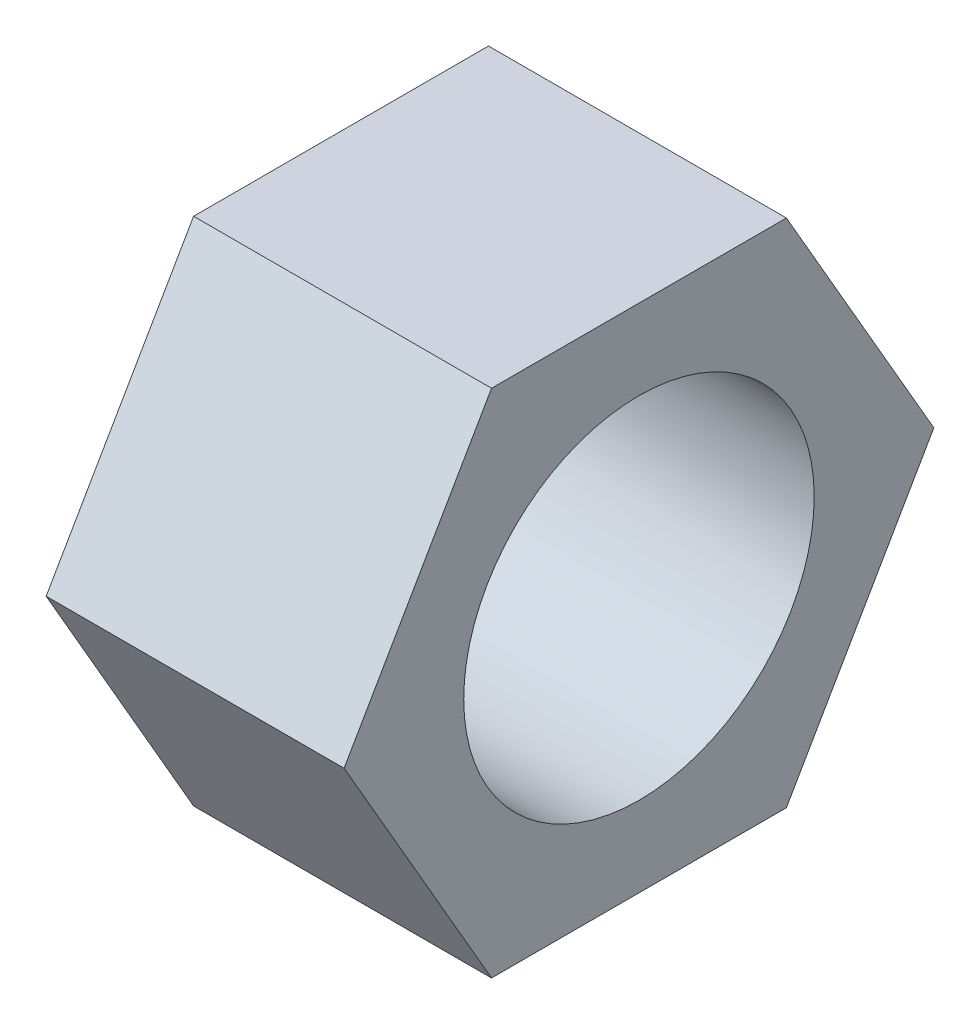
ISO-10303-21;
HEADER;
FILE_DESCRIPTION(('STEP AP214'),'2;1');
FILE_NAME('part.step','',(''),(''),'','','');
FILE_SCHEMA(('AUTOMOTIVE_DESIGN { 1 0 10303 214 1 1 1 1 }'));
ENDSEC;
DATA;
#1=APPLICATION_CONTEXT('core data for automotive mechanical design processes');
#2=APPLICATION_PROTOCOL_DEFINITION('international standard','automotive_design',2000,#1);
#3=PRODUCT_CONTEXT('',#1,'mechanical');
#4=PRODUCT('Part','Part','',(#3));
#5=PRODUCT_RELATED_PRODUCT_CATEGORY('part','',(#4));
#6=PRODUCT_DEFINITION_FORMATION('','',#4);
#7=PRODUCT_DEFINITION_CONTEXT('part definition',#1,'design');
#8=PRODUCT_DEFINITION('design','',#6,#7);
#9=PRODUCT_DEFINITION_SHAPE('','',#8);
#10=(LENGTH_UNIT() NAMED_UNIT(*) SI_UNIT(.MILLI.,.METRE.));
#11=(NAMED_UNIT(*) PLANE_ANGLE_UNIT() SI_UNIT($,.RADIAN.));
#12=(NAMED_UNIT(*) SI_UNIT($,.STERADIAN.) SOLID_ANGLE_UNIT());
#13=UNCERTAINTY_MEASURE_WITH_UNIT(LENGTH_MEASURE(1.E-05),#10,'distance_accuracy_value','');
#14=(GEOMETRIC_REPRESENTATION_CONTEXT(3) GLOBAL_UNCERTAINTY_ASSIGNED_CONTEXT((#13)) GLOBAL_UNIT_ASSIGNED_CONTEXT((#10,
#11,#12)) REPRESENTATION_CONTEXT('',''));
#15=CARTESIAN_POINT('',(0.,0.,0.));
#16=DIRECTION('',(0.,0.,1.));
#17=DIRECTION('',(1.,0.,0.));
#18=AXIS2_PLACEMENT_3D('',#15,#16,#17);
#19=CARTESIAN_POINT('',(8.334375,0.,-8.24889197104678));
#20=DIRECTION('',(0.,-0.5,0.866025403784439));
#21=DIRECTION('',(0.,-0.866025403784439,-0.5));
#22=AXIS2_PLACEMENT_3D('',#19,#20,#21);
#23=PLANE('',#22);
#24=DIRECTION('',(0.,0.866025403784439,0.5));
#25=VECTOR('',#24,1.);
#26=CARTESIAN_POINT('',(0.,0.,-8.24889197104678));
#27=LINE('',#26,#25);
#28=CARTESIAN_POINT('',(0.,0.,-8.24889197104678));
#29=VERTEX_POINT('',#28);
#30=CARTESIAN_POINT('',(0.,7.14375,-4.12444598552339));
#31=VERTEX_POINT('',#30);
#32=EDGE_CURVE('E116',#29,#31,#27,.T.);
#33=ORIENTED_EDGE('',*,*,#32,.T.);
#34=DIRECTION('',(-1.,0.,0.));
#35=VECTOR('',#34,1.);
#36=CARTESIAN_POINT('',(8.334375,7.14375,-4.12444598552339));
#37=LINE('',#36,#35);
#38=CARTESIAN_POINT('',(8.334375,7.14375,-4.12444598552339));
#39=VERTEX_POINT('',#38);
#40=EDGE_CURVE('E11',#39,#31,#37,.T.);
#41=ORIENTED_EDGE('',*,*,#40,.F.);
#42=DIRECTION('',(0.,0.866025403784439,0.5));
#43=VECTOR('',#42,1.);
#44=CARTESIAN_POINT('',(8.334375,0.,-8.24889197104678));
#45=LINE('',#44,#43);
#46=CARTESIAN_POINT('',(8.334375,0.,-8.24889197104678));
#47=VERTEX_POINT('',#46);
#48=EDGE_CURVE('E127',#47,#39,#45,.T.);
#49=ORIENTED_EDGE('',*,*,#48,.F.);
#50=DIRECTION('',(-1.,0.,0.));
#51=VECTOR('',#50,1.);
#52=CARTESIAN_POINT('',(8.334375,0.,-8.24889197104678));
#53=LINE('',#52,#51);
#54=EDGE_CURVE('E112',#47,#29,#53,.T.);
#55=ORIENTED_EDGE('',*,*,#54,.T.);
#56=EDGE_LOOP('',(#33,#41,#49,#55));
#57=FACE_BOUND('',#56,.T.);
#58=ADVANCED_FACE('F32',(#57),#23,.F.);
#59=CARTESIAN_POINT('',(8.334375,7.14375,-4.12444598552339));
#60=DIRECTION('',(0.,-1.,0.));
#61=DIRECTION('',(0.,0.,-1.));
#62=AXIS2_PLACEMENT_3D('',#59,#60,#61);
#63=PLANE('',#62);
#64=DIRECTION('',(0.,0.,1.));
#65=VECTOR('',#64,1.);
#66=CARTESIAN_POINT('',(0.,7.14375,-4.12444598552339));
#67=LINE('',#66,#65);
#68=CARTESIAN_POINT('',(0.,7.14375,4.12444598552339));
#69=VERTEX_POINT('',#68);
#70=EDGE_CURVE('E119',#31,#69,#67,.T.);
#71=ORIENTED_EDGE('',*,*,#70,.T.);
#72=DIRECTION('',(-1.,0.,0.));
#73=VECTOR('',#72,1.);
#74=CARTESIAN_POINT('',(8.334375,7.14375,4.12444598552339));
#75=LINE('',#74,#73);
#76=CARTESIAN_POINT('',(8.334375,7.14375,4.12444598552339));
#77=VERTEX_POINT('',#76);
#78=EDGE_CURVE('E40',#77,#69,#75,.T.);
#79=ORIENTED_EDGE('',*,*,#78,.F.);
#80=DIRECTION('',(0.,0.,1.));
#81=VECTOR('',#80,1.);
#82=CARTESIAN_POINT('',(8.334375,7.14375,-4.12444598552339));
#83=LINE('',#82,#81);
#84=EDGE_CURVE('E85',#39,#77,#83,.T.);
#85=ORIENTED_EDGE('',*,*,#84,.F.);
#86=ORIENTED_EDGE('',*,*,#40,.T.);
#87=EDGE_LOOP('',(#71,#79,#85,#86));
#88=FACE_BOUND('',#87,.T.);
#89=ADVANCED_FACE('F152',(#88),#63,.F.);
#90=CARTESIAN_POINT('',(8.334375,7.14375,4.12444598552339));
#91=DIRECTION('',(0.,-0.5,-0.866025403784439));
#92=DIRECTION('',(0.,0.866025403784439,-0.5));
#93=AXIS2_PLACEMENT_3D('',#90,#91,#92);
#94=PLANE('',#93);
#95=DIRECTION('',(0.,-0.866025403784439,0.5));
#96=VECTOR('',#95,1.);
#97=CARTESIAN_POINT('',(0.,7.14375,4.12444598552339));
#98=LINE('',#97,#96);
#99=CARTESIAN_POINT('',(0.,0.,8.24889197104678));
#100=VERTEX_POINT('',#99);
#101=EDGE_CURVE('E122',#69,#100,#98,.T.);
#102=ORIENTED_EDGE('',*,*,#101,.T.);
#103=DIRECTION('',(-1.,0.,0.));
#104=VECTOR('',#103,1.);
#105=CARTESIAN_POINT('',(8.334375,0.,8.24889197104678));
#106=LINE('',#105,#104);
#107=CARTESIAN_POINT('',(8.334375,0.,8.24889197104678));
#108=VERTEX_POINT('',#107);
#109=EDGE_CURVE('E107',#108,#100,#106,.T.);
#110=ORIENTED_EDGE('',*,*,#109,.F.);
#111=DIRECTION('',(0.,-0.866025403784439,0.5));
#112=VECTOR('',#111,1.);
#113=CARTESIAN_POINT('',(8.334375,7.14375,4.12444598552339));
#114=LINE('',#113,#112);
#115=EDGE_CURVE('E98',#77,#108,#114,.T.);
#116=ORIENTED_EDGE('',*,*,#115,.F.);
#117=ORIENTED_EDGE('',*,*,#78,.T.);
#118=EDGE_LOOP('',(#102,#110,#116,#117));
#119=FACE_BOUND('',#118,.T.);
#120=ADVANCED_FACE('F133',(#119),#94,.F.);
#121=CARTESIAN_POINT('',(8.334375,0.,8.24889197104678));
#122=DIRECTION('',(0.,0.5,-0.866025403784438));
#123=DIRECTION('',(0.,0.866025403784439,0.5));
#124=AXIS2_PLACEMENT_3D('',#121,#122,#123);
#125=PLANE('',#124);
#126=DIRECTION('',(0.,-0.866025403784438,-0.5));
#127=VECTOR('',#126,1.);
#128=CARTESIAN_POINT('',(0.,0.,8.24889197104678));
#129=LINE('',#128,#127);
#130=CARTESIAN_POINT('',(0.,-7.14375,4.12444598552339));
#131=VERTEX_POINT('',#130);
#132=EDGE_CURVE('E106',#100,#131,#129,.T.);
#133=ORIENTED_EDGE('',*,*,#132,.T.);
#134=DIRECTION('',(-1.,0.,0.));
#135=VECTOR('',#134,1.);
#136=CARTESIAN_POINT('',(8.334375,-7.14375,4.12444598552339));
#137=LINE('',#136,#135);
#138=CARTESIAN_POINT('',(8.334375,-7.14375,4.12444598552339));
#139=VERTEX_POINT('',#138);
#140=EDGE_CURVE('E103',#139,#131,#137,.T.);
#141=ORIENTED_EDGE('',*,*,#140,.F.);
#142=DIRECTION('',(0.,-0.866025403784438,-0.5));
#143=VECTOR('',#142,1.);
#144=CARTESIAN_POINT('',(8.334375,0.,8.24889197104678));
#145=LINE('',#144,#143);
#146=EDGE_CURVE('E92',#108,#139,#145,.T.);
#147=ORIENTED_EDGE('',*,*,#146,.F.);
#148=ORIENTED_EDGE('',*,*,#109,.T.);
#149=EDGE_LOOP('',(#133,#141,#147,#148));
#150=FACE_BOUND('',#149,.T.);
#151=ADVANCED_FACE('F104',(#150),#125,.F.);
#152=CARTESIAN_POINT('',(8.334375,-7.14375,4.12444598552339));
#153=DIRECTION('',(0.,1.,0.));
#154=DIRECTION('',(0.,0.,1.));
#155=AXIS2_PLACEMENT_3D('',#152,#153,#154);
#156=PLANE('',#155);
#157=DIRECTION('',(0.,0.,-1.));
#158=VECTOR('',#157,1.);
#159=CARTESIAN_POINT('',(0.,-7.14375,4.12444598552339));
#160=LINE('',#159,#158);
#161=CARTESIAN_POINT('',(0.,-7.14375,-4.12444598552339));
#162=VERTEX_POINT('',#161);
#163=EDGE_CURVE('E71',#131,#162,#160,.T.);
#164=ORIENTED_EDGE('',*,*,#163,.T.);
#165=DIRECTION('',(-1.,0.,0.));
#166=VECTOR('',#165,1.);
#167=CARTESIAN_POINT('',(8.334375,-7.14375,-4.12444598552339));
#168=LINE('',#167,#166);
#169=CARTESIAN_POINT('',(8.334375,-7.14375,-4.12444598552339));
#170=VERTEX_POINT('',#169);
#171=EDGE_CURVE('E108',#170,#162,#168,.T.);
#172=ORIENTED_EDGE('',*,*,#171,.F.);
#173=DIRECTION('',(0.,0.,-1.));
#174=VECTOR('',#173,1.);
#175=CARTESIAN_POINT('',(8.334375,-7.14375,4.12444598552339));
#176=LINE('',#175,#174);
#177=EDGE_CURVE('E96',#139,#170,#176,.T.);
#178=ORIENTED_EDGE('',*,*,#177,.F.);
#179=ORIENTED_EDGE('',*,*,#140,.T.);
#180=EDGE_LOOP('',(#164,#172,#178,#179));
#181=FACE_BOUND('',#180,.T.);
#182=ADVANCED_FACE('F110',(#181),#156,.F.);
#183=CARTESIAN_POINT('',(8.334375,-7.14375,-4.12444598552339));
#184=DIRECTION('',(0.,0.5,0.866025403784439));
#185=DIRECTION('',(0.,-0.866025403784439,0.5));
#186=AXIS2_PLACEMENT_3D('',#183,#184,#185);
#187=PLANE('',#186);
#188=DIRECTION('',(0.,0.866025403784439,-0.5));
#189=VECTOR('',#188,1.);
#190=CARTESIAN_POINT('',(0.,-7.14375,-4.12444598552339));
#191=LINE('',#190,#189);
#192=EDGE_CURVE('E77',#162,#29,#191,.T.);
#193=ORIENTED_EDGE('',*,*,#192,.T.);
#194=ORIENTED_EDGE('',*,*,#54,.F.);
#195=DIRECTION('',(0.,0.866025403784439,-0.5));
#196=VECTOR('',#195,1.);
#197=CARTESIAN_POINT('',(8.334375,-7.14375,-4.12444598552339));
#198=LINE('',#197,#196);
#199=EDGE_CURVE('E48',#170,#47,#198,.T.);
#200=ORIENTED_EDGE('',*,*,#199,.F.);
#201=ORIENTED_EDGE('',*,*,#171,.T.);
#202=EDGE_LOOP('',(#193,#194,#200,#201));
#203=FACE_BOUND('',#202,.T.);
#204=ADVANCED_FACE('F140',(#203),#187,.F.);
#205=CARTESIAN_POINT('',(8.334375,0.,0.));
#206=DIRECTION('',(1.,0.,0.));
#207=DIRECTION('',(0.,0.,-1.));
#208=AXIS2_PLACEMENT_3D('',#205,#206,#207);
#209=PLANE('',#208);
#210=CARTESIAN_POINT('',(8.334375,0.,0.));
#211=DIRECTION('',(1.,0.,0.));
#212=DIRECTION('',(0.,0.,-1.));
#213=AXIS2_PLACEMENT_3D('',#210,#211,#212);
#214=CIRCLE('',#213,4.90219999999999);
#215=CARTESIAN_POINT('',(8.334375,0.,-4.90219999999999));
#216=VERTEX_POINT('',#215);
#217=EDGE_CURVE('E207',#216,#216,#214,.T.);
#218=ORIENTED_EDGE('',*,*,#217,.F.);
#219=EDGE_LOOP('',(#218));
#220=FACE_BOUND('',#219,.T.);
#221=ORIENTED_EDGE('',*,*,#48,.T.);
#222=ORIENTED_EDGE('',*,*,#84,.T.);
#223=ORIENTED_EDGE('',*,*,#115,.T.);
#224=ORIENTED_EDGE('',*,*,#146,.T.);
#225=ORIENTED_EDGE('',*,*,#177,.T.);
#226=ORIENTED_EDGE('',*,*,#199,.T.);
#227=EDGE_LOOP('',(#221,#222,#223,#224,#225,#226));
#228=FACE_BOUND('',#227,.T.);
#229=ADVANCED_FACE('F94',(#220,#228),#209,.T.);
#230=CARTESIAN_POINT('',(0.,0.,0.));
#231=DIRECTION('',(1.,0.,0.));
#232=DIRECTION('',(0.,0.,-1.));
#233=AXIS2_PLACEMENT_3D('',#230,#231,#232);
#234=PLANE('',#233);
#235=CARTESIAN_POINT('',(0.,0.,0.));
#236=DIRECTION('',(1.,0.,0.));
#237=DIRECTION('',(0.,0.,-1.));
#238=AXIS2_PLACEMENT_3D('',#235,#236,#237);
#239=CIRCLE('',#238,4.9022);
#240=CARTESIAN_POINT('',(0.,0.,-4.9022));
#241=VERTEX_POINT('',#240);
#242=EDGE_CURVE('E120',#241,#241,#239,.T.);
#243=ORIENTED_EDGE('',*,*,#242,.T.);
#244=EDGE_LOOP('',(#243));
#245=FACE_BOUND('',#244,.T.);
#246=ORIENTED_EDGE('',*,*,#32,.F.);
#247=ORIENTED_EDGE('',*,*,#192,.F.);
#248=ORIENTED_EDGE('',*,*,#163,.F.);
#249=ORIENTED_EDGE('',*,*,#132,.F.);
#250=ORIENTED_EDGE('',*,*,#101,.F.);
#251=ORIENTED_EDGE('',*,*,#70,.F.);
#252=EDGE_LOOP('',(#246,#247,#248,#249,#250,#251));
#253=FACE_BOUND('',#252,.T.);
#254=ADVANCED_FACE('F136',(#245,#253),#234,.F.);
#255=CARTESIAN_POINT('',(8.334375,0.,0.));
#256=DIRECTION('',(1.,0.,0.));
#257=DIRECTION('',(0.,0.,-1.));
#258=AXIS2_PLACEMENT_3D('',#255,#256,#257);
#259=CYLINDRICAL_SURFACE('',#258,4.90219999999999);
#260=ORIENTED_EDGE('',*,*,#242,.F.);
#261=EDGE_LOOP('',(#260));
#262=FACE_BOUND('',#261,.T.);
#263=ORIENTED_EDGE('',*,*,#217,.T.);
#264=EDGE_LOOP('',(#263));
#265=FACE_BOUND('',#264,.T.);
#266=ADVANCED_FACE('F189',(#262,#265),#259,.F.);
#267=CLOSED_SHELL('',(#58,#89,#120,#151,#182,#204,#229,#254,#266));
#268=MANIFOLD_SOLID_BREP('B2',#267);
#269=ADVANCED_BREP_SHAPE_REPRESENTATION('',(#18,#268),#14);
#270=SHAPE_DEFINITION_REPRESENTATION(#9,#269);
ENDSEC;
END-ISO-10303-21;
